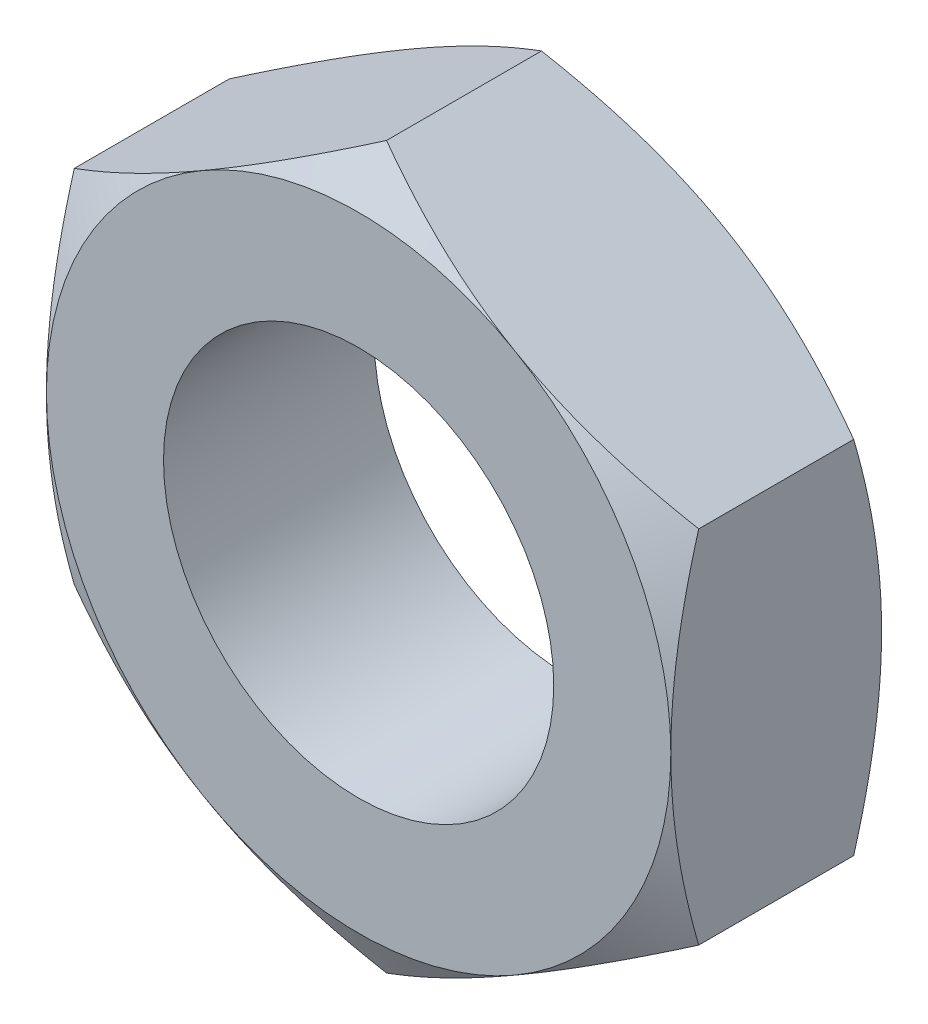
ISO-10303-21;
HEADER;
FILE_DESCRIPTION(('STEP AP214'),'2;1');
FILE_NAME('part.step','',(''),(''),'','','');
FILE_SCHEMA(('AUTOMOTIVE_DESIGN { 1 0 10303 214 1 1 1 1 }'));
ENDSEC;
DATA;
#1=APPLICATION_CONTEXT('core data for automotive mechanical design processes');
#2=APPLICATION_PROTOCOL_DEFINITION('international standard','automotive_design',2000,#1);
#3=PRODUCT_CONTEXT('',#1,'mechanical');
#4=PRODUCT('Part','Part','',(#3));
#5=PRODUCT_RELATED_PRODUCT_CATEGORY('part','',(#4));
#6=PRODUCT_DEFINITION_FORMATION('','',#4);
#7=PRODUCT_DEFINITION_CONTEXT('part definition',#1,'design');
#8=PRODUCT_DEFINITION('design','',#6,#7);
#9=PRODUCT_DEFINITION_SHAPE('','',#8);
#10=(LENGTH_UNIT() NAMED_UNIT(*) SI_UNIT(.MILLI.,.METRE.));
#11=(NAMED_UNIT(*) PLANE_ANGLE_UNIT() SI_UNIT($,.RADIAN.));
#12=(NAMED_UNIT(*) SI_UNIT($,.STERADIAN.) SOLID_ANGLE_UNIT());
#13=UNCERTAINTY_MEASURE_WITH_UNIT(LENGTH_MEASURE(1.E-05),#10,'distance_accuracy_value','');
#14=(GEOMETRIC_REPRESENTATION_CONTEXT(3) GLOBAL_UNCERTAINTY_ASSIGNED_CONTEXT((#13)) GLOBAL_UNIT_ASSIGNED_CONTEXT((#10,
#11,#12)) REPRESENTATION_CONTEXT('',''));
#15=CARTESIAN_POINT('',(0.,0.,0.));
#16=DIRECTION('',(0.,0.,1.));
#17=DIRECTION('',(1.,0.,0.));
#18=AXIS2_PLACEMENT_3D('',#15,#16,#17);
#19=CARTESIAN_POINT('',(0.,0.,2.7));
#20=DIRECTION('',(0.,0.,-1.));
#21=DIRECTION('',(-1.,0.,0.));
#22=AXIS2_PLACEMENT_3D('',#19,#20,#21);
#23=CONICAL_SURFACE('',#22,4.,1.0471975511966);
#24=CARTESIAN_POINT('',(0.000199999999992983,4.61891762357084,2.34266774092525));
#25=CARTESIAN_POINT('',(-0.175579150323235,4.5174314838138,2.40128212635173));
#26=CARTESIAN_POINT('',(-0.352875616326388,4.41506932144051,2.45458967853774));
#27=CARTESIAN_POINT('',(-0.710538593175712,4.20857250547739,2.5476383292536));
#28=CARTESIAN_POINT('',(-0.890911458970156,4.10443418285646,2.5873465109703));
#29=CARTESIAN_POINT('',(-1.24942181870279,3.89744813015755,2.64915778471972));
#30=CARTESIAN_POINT('',(-1.42750415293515,3.79463224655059,2.67167226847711));
#31=CARTESIAN_POINT('',(-1.78450671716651,3.58851671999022,2.69854937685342));
#32=CARTESIAN_POINT('',(-1.9634256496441,3.48521782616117,2.70293425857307));
#33=CARTESIAN_POINT('',(-2.29774284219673,3.29219970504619,2.69380992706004));
#34=CARTESIAN_POINT('',(-2.45319115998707,3.20245157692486,2.68254104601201));
#35=CARTESIAN_POINT('',(-2.76307505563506,3.02354002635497,2.64682600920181));
#36=CARTESIAN_POINT('',(-2.91750956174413,2.93437722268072,2.62236765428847));
#37=CARTESIAN_POINT('',(-3.22803232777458,2.75509682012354,2.56122393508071));
#38=CARTESIAN_POINT('',(-3.3840812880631,2.6650019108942,2.52427939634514));
#39=CARTESIAN_POINT('',(-3.69385183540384,2.486155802,2.44042992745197));
#40=CARTESIAN_POINT('',(-3.84757739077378,2.39740231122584,2.39354469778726));
#41=CARTESIAN_POINT('',(-4.0002,2.30928560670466,2.34266774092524));
#42=B_SPLINE_CURVE_WITH_KNOTS('',3,(#24,#25,#26,#27,#28,#29,#30,#31,#32,#33,#34,#35,#36,#37,#38,
#39,#40,#41),.UNSPECIFIED.,.F.,.F.,(4,2,2,2,2,2,2,2,4),(0.,0.634047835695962,1.26961969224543,
1.88946157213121,2.50854226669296,3.04757825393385,3.58711366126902,4.13861653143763,
4.68903648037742),.UNSPECIFIED.);
#43=CARTESIAN_POINT('',(-2.,3.46410161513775,2.7));
#44=VERTEX_POINT('',#43);
#45=CARTESIAN_POINT('',(-4.,2.3094010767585,2.34273441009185));
#46=VERTEX_POINT('',#45);
#47=EDGE_CURVE('E186',#44,#46,#42,.T.);
#48=ORIENTED_EDGE('',*,*,#47,.T.);
#49=CARTESIAN_POINT('',(-4.,-6.26364060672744,0.718589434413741));
#50=CARTESIAN_POINT('',(-4.,-6.08842377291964,0.803826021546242));
#51=CARTESIAN_POINT('',(-4.,-5.91281114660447,0.888262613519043));
#52=CARTESIAN_POINT('',(-4.,-5.5605840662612,1.055087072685));
#53=CARTESIAN_POINT('',(-4.,-5.38396946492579,1.13747462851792));
#54=CARTESIAN_POINT('',(-4.,-5.02864676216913,1.30015398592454));
#55=CARTESIAN_POINT('',(-4.,-4.84993253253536,1.38043244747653));
#56=CARTESIAN_POINT('',(-4.,-4.49110364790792,1.53778388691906));
#57=CARTESIAN_POINT('',(-4.,-4.31098905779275,1.61485701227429));
#58=CARTESIAN_POINT('',(-4.,-3.94302250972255,1.76746292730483));
#59=CARTESIAN_POINT('',(-4.,-3.75511317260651,1.84285810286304));
#60=CARTESIAN_POINT('',(-4.,-3.37711839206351,1.9880869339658));
#61=CARTESIAN_POINT('',(-4.,-3.18703271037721,2.05791997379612));
#62=CARTESIAN_POINT('',(-4.,-2.80471962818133,2.19023530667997));
#63=CARTESIAN_POINT('',(-4.,-2.61249725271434,2.25273197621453));
#64=CARTESIAN_POINT('',(-4.,-2.22529544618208,2.36840901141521));
#65=CARTESIAN_POINT('',(-4.,-2.03031688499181,2.42159224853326));
#66=CARTESIAN_POINT('',(-4.,-1.63859185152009,2.51584231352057));
#67=CARTESIAN_POINT('',(-4.,-1.44186209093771,2.55697733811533));
#68=CARTESIAN_POINT('',(-4.,-1.04589364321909,2.62485163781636));
#69=CARTESIAN_POINT('',(-4.,-0.846655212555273,2.65159237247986));
#70=CARTESIAN_POINT('',(-4.,-0.449291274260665,2.68819745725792));
#71=CARTESIAN_POINT('',(-4.,-0.251186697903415,2.69828341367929));
#72=CARTESIAN_POINT('',(-4.,0.14517164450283,2.70131104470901));
#73=CARTESIAN_POINT('',(-4.,0.34342541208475,2.69425254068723));
#74=CARTESIAN_POINT('',(-4.,0.678239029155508,2.66836003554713));
#75=CARTESIAN_POINT('',(-4.,0.815149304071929,2.65378059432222));
#76=CARTESIAN_POINT('',(-4.,1.08800080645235,2.61732105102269));
#77=CARTESIAN_POINT('',(-4.,1.2239419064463,2.59544000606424));
#78=CARTESIAN_POINT('',(-4.,1.63011244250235,2.51999097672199));
#79=CARTESIAN_POINT('',(-4.,1.89854481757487,2.45662977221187));
#80=CARTESIAN_POINT('',(-4.,2.2999975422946,2.34633889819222));
#81=CARTESIAN_POINT('',(-4.,2.4350877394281,2.30651044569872));
#82=CARTESIAN_POINT('',(-4.,2.7039569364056,2.22261108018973));
#83=CARTESIAN_POINT('',(-4.,2.83773592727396,2.17854013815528));
#84=CARTESIAN_POINT('',(-4.,3.10402296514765,2.08687174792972));
#85=CARTESIAN_POINT('',(-4.,3.2365313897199,2.03927538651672));
#86=CARTESIAN_POINT('',(-4.,3.50044341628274,1.94112660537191));
#87=CARTESIAN_POINT('',(-4.,3.63184703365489,1.89057422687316));
#88=CARTESIAN_POINT('',(-4.,3.95099591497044,1.76432597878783));
#89=CARTESIAN_POINT('',(-4.,4.13821908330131,1.68731241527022));
#90=CARTESIAN_POINT('',(-4.,4.51098760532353,1.52931419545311));
#91=CARTESIAN_POINT('',(-4.,4.69653283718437,1.44832925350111));
#92=CARTESIAN_POINT('',(-4.,5.06626865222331,1.28321706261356));
#93=CARTESIAN_POINT('',(-4.,5.25045890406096,1.19908907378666));
#94=CARTESIAN_POINT('',(-4.,5.61768203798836,1.02833991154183));
#95=CARTESIAN_POINT('',(-4.,5.8007148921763,0.941718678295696));
#96=CARTESIAN_POINT('',(-4.,6.34881556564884,0.678661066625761));
#97=CARTESIAN_POINT('',(-3.99999999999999,6.71244516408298,0.499230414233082));
#98=CARTESIAN_POINT('',(-3.99999999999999,7.43696538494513,0.13508420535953));
#99=CARTESIAN_POINT('',(-3.99999999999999,7.79785638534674,-0.0496306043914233));
#100=CARTESIAN_POINT('',(-3.99999999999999,8.4857534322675,-0.406230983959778));
#101=CARTESIAN_POINT('',(-3.99999999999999,8.81292387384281,-0.577800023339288));
#102=CARTESIAN_POINT('',(-3.99999999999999,9.46605617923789,-0.92325186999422));
#103=CARTESIAN_POINT('',(-3.99999999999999,9.79201799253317,-1.09713477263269));
#104=CARTESIAN_POINT('',(-3.99999999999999,10.4421073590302,-1.44617315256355));
#105=CARTESIAN_POINT('',(-3.99999999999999,10.7662374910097,-1.62132383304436));
#106=CARTESIAN_POINT('',(-3.99999999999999,11.4137299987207,-1.97299216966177));
#107=CARTESIAN_POINT('',(-3.99999999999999,11.7370924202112,-2.14950974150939));
#108=CARTESIAN_POINT('',(-4.,12.0601752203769,-2.32653390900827));
#109=B_SPLINE_CURVE_WITH_KNOTS('',3,(#49,#50,#51,#52,#53,#54,#55,#56,#57,#58,#59,#60,#61,#62,
#63,#64,#65,#66,#67,#68,#69,#70,#71,#72,#73,#74,#75,#76,#77,#78,#79,#80,#81,#82,#83,#84,#85,#86,
#87,#88,#89,#90,#91,#92,#93,#94,#95,#96,#97,#98,#99,#100,#101,#102,#103,#104,#105,#106,#107,
#108),.UNSPECIFIED.,.F.,.F.,(4,2,2,2,2,2,2,2,2,2,2,2,2,2,2,2,2,2,2,2,2,2,2,2,2,2,2,2,2,4),(0.,
0.584554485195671,1.16919725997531,1.75692253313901,2.344620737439,2.95196450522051,
3.5593754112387,4.16557541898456,4.77158819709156,5.37410134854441,5.97655339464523,
6.57092272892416,7.16529825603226,7.57815214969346,7.99105937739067,8.81730640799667,
9.23978652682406,9.66226953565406,10.0846228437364,10.5069702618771,11.1142392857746,
11.7215520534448,12.3290086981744,12.936479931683,14.1528724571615,15.3690939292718,
16.477363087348,17.5856780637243,18.6909540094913,19.7961623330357),.UNSPECIFIED.);
#110=CARTESIAN_POINT('',(-4.,0.,2.7));
#111=VERTEX_POINT('',#110);
#112=EDGE_CURVE('E210',#46,#111,#109,.F.);
#113=ORIENTED_EDGE('',*,*,#112,.T.);
#114=CARTESIAN_POINT('',(0.,0.,2.7));
#115=DIRECTION('',(0.,0.,-1.));
#116=DIRECTION('',(-1.,0.,0.));
#117=AXIS2_PLACEMENT_3D('',#114,#115,#116);
#118=CIRCLE('',#117,4.);
#119=EDGE_CURVE('E281',#111,#44,#118,.T.);
#120=ORIENTED_EDGE('',*,*,#119,.T.);
#121=EDGE_LOOP('',(#48,#113,#120));
#122=FACE_BOUND('',#121,.T.);
#123=ADVANCED_FACE('F14',(#122),#23,.T.);
#124=CARTESIAN_POINT('',(-2.,-3.46410161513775,2.7));
#125=VERTEX_POINT('',#124);
#126=EDGE_CURVE('E280',#125,#111,#118,.T.);
#127=ORIENTED_EDGE('',*,*,#126,.T.);
#128=CARTESIAN_POINT('',(-4.,-2.3094010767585,2.34273441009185));
#129=VERTEX_POINT('',#128);
#130=EDGE_CURVE('E203',#111,#129,#109,.F.);
#131=ORIENTED_EDGE('',*,*,#130,.T.);
#132=CARTESIAN_POINT('',(-4.0002,-2.30928560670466,2.34266774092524));
#133=CARTESIAN_POINT('',(-3.82442084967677,-2.4107717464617,2.40128212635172));
#134=CARTESIAN_POINT('',(-3.64712438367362,-2.51313390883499,2.45458967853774));
#135=CARTESIAN_POINT('',(-3.28946140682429,-2.71963072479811,2.5476383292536));
#136=CARTESIAN_POINT('',(-3.10908854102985,-2.82376904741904,2.5873465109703));
#137=CARTESIAN_POINT('',(-2.75057818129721,-3.03075510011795,2.64915778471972));
#138=CARTESIAN_POINT('',(-2.57249584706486,-3.13357098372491,2.67167226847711));
#139=CARTESIAN_POINT('',(-2.21549328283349,-3.33968651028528,2.69854937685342));
#140=CARTESIAN_POINT('',(-2.0365743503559,-3.44298540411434,2.70293425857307));
#141=CARTESIAN_POINT('',(-1.70225715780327,-3.63600352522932,2.69380992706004));
#142=CARTESIAN_POINT('',(-1.54680884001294,-3.72575165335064,2.68254104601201));
#143=CARTESIAN_POINT('',(-1.23692494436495,-3.90466320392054,2.64682600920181));
#144=CARTESIAN_POINT('',(-1.08249043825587,-3.99382600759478,2.62236765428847));
#145=CARTESIAN_POINT('',(-0.771967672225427,-4.17310641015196,2.56122393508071));
#146=CARTESIAN_POINT('',(-0.615918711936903,-4.2632013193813,2.52427939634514));
#147=CARTESIAN_POINT('',(-0.306148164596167,-4.4420474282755,2.44042992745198));
#148=CARTESIAN_POINT('',(-0.152422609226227,-4.53080091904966,2.39354469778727));
#149=CARTESIAN_POINT('',(0.000199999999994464,-4.61891762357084,2.34266774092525));
#150=B_SPLINE_CURVE_WITH_KNOTS('',3,(#132,#133,#134,#135,#136,#137,#138,#139,#140,#141,#142,
#143,#144,#145,#146,#147,#148,#149),.UNSPECIFIED.,.F.,.F.,(4,2,2,2,2,2,2,2,4),(0.,
0.634047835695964,1.26961969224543,1.88946157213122,2.50854226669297,3.04757825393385,
3.58711366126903,4.13861653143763,4.68903648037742),.UNSPECIFIED.);
#151=EDGE_CURVE('E332',#129,#125,#150,.T.);
#152=ORIENTED_EDGE('',*,*,#151,.T.);
#153=EDGE_LOOP('',(#127,#131,#152));
#154=FACE_BOUND('',#153,.T.);
#155=ADVANCED_FACE('F243',(#154),#23,.T.);
#156=CARTESIAN_POINT('',(2.,-3.46410161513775,2.7));
#157=VERTEX_POINT('',#156);
#158=EDGE_CURVE('E277',#157,#125,#118,.T.);
#159=ORIENTED_EDGE('',*,*,#158,.T.);
#160=CARTESIAN_POINT('',(0.,-4.618802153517,2.34273441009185));
#161=VERTEX_POINT('',#160);
#162=EDGE_CURVE('E219',#125,#161,#150,.T.);
#163=ORIENTED_EDGE('',*,*,#162,.T.);
#164=CARTESIAN_POINT('',(-0.000200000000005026,-4.61891762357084,2.34266774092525));
#165=CARTESIAN_POINT('',(0.175579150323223,-4.5174314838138,2.40128212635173));
#166=CARTESIAN_POINT('',(0.352875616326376,-4.41506932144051,2.45458967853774));
#167=CARTESIAN_POINT('',(0.7105385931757,-4.20857250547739,2.5476383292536));
#168=CARTESIAN_POINT('',(0.890911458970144,-4.10443418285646,2.5873465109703));
#169=CARTESIAN_POINT('',(1.24942181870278,-3.89744813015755,2.64915778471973));
#170=CARTESIAN_POINT('',(1.42750415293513,-3.79463224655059,2.67167226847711));
#171=CARTESIAN_POINT('',(1.7845067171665,-3.58851671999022,2.69854937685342));
#172=CARTESIAN_POINT('',(1.96342564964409,-3.48521782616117,2.70293425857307));
#173=CARTESIAN_POINT('',(2.29774284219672,-3.29219970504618,2.69380992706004));
#174=CARTESIAN_POINT('',(2.45319115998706,-3.20245157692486,2.68254104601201));
#175=CARTESIAN_POINT('',(2.76307505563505,-3.02354002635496,2.64682600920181));
#176=CARTESIAN_POINT('',(2.91750956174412,-2.93437722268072,2.62236765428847));
#177=CARTESIAN_POINT('',(3.22803232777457,-2.75509682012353,2.56122393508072));
#178=CARTESIAN_POINT('',(3.38408128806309,-2.66500191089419,2.52427939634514));
#179=CARTESIAN_POINT('',(3.69385183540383,-2.486155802,2.44042992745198));
#180=CARTESIAN_POINT('',(3.84757739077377,-2.39740231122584,2.39354469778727));
#181=CARTESIAN_POINT('',(4.0002,-2.30928560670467,2.34266774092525));
#182=B_SPLINE_CURVE_WITH_KNOTS('',3,(#164,#165,#166,#167,#168,#169,#170,#171,#172,#173,#174,
#175,#176,#177,#178,#179,#180,#181),.UNSPECIFIED.,.F.,.F.,(4,2,2,2,2,2,2,2,4),(0.,
0.634047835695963,1.26961969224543,1.88946157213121,2.50854226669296,3.04757825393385,
3.58711366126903,4.13861653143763,4.68903648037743),.UNSPECIFIED.);
#183=EDGE_CURVE('E288',#161,#157,#182,.T.);
#184=ORIENTED_EDGE('',*,*,#183,.T.);
#185=EDGE_LOOP('',(#159,#163,#184));
#186=FACE_BOUND('',#185,.T.);
#187=ADVANCED_FACE('F248',(#186),#23,.T.);
#188=CARTESIAN_POINT('',(4.0002,2.30928560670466,2.34266774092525));
#189=CARTESIAN_POINT('',(3.82442084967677,2.4107717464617,2.40128212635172));
#190=CARTESIAN_POINT('',(3.64712438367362,2.51313390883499,2.45458967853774));
#191=CARTESIAN_POINT('',(3.28946140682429,2.71963072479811,2.5476383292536));
#192=CARTESIAN_POINT('',(3.10908854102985,2.82376904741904,2.5873465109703));
#193=CARTESIAN_POINT('',(2.75057818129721,3.03075510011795,2.64915778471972));
#194=CARTESIAN_POINT('',(2.57249584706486,3.13357098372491,2.67167226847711));
#195=CARTESIAN_POINT('',(2.21549328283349,3.33968651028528,2.69854937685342));
#196=CARTESIAN_POINT('',(2.0365743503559,3.44298540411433,2.70293425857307));
#197=CARTESIAN_POINT('',(1.70225715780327,3.63600352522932,2.69380992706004));
#198=CARTESIAN_POINT('',(1.54680884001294,3.72575165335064,2.68254104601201));
#199=CARTESIAN_POINT('',(1.23692494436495,3.90466320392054,2.64682600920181));
#200=CARTESIAN_POINT('',(1.08249043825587,3.99382600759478,2.62236765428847));
#201=CARTESIAN_POINT('',(0.771967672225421,4.17310641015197,2.56122393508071));
#202=CARTESIAN_POINT('',(0.615918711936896,4.26320131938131,2.52427939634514));
#203=CARTESIAN_POINT('',(0.306148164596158,4.4420474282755,2.44042992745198));
#204=CARTESIAN_POINT('',(0.152422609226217,4.53080091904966,2.39354469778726));
#205=CARTESIAN_POINT('',(-0.000200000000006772,4.61891762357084,2.34266774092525));
#206=B_SPLINE_CURVE_WITH_KNOTS('',3,(#188,#189,#190,#191,#192,#193,#194,#195,#196,#197,#198,
#199,#200,#201,#202,#203,#204,#205),.UNSPECIFIED.,.F.,.F.,(4,2,2,2,2,2,2,2,4),(0.,
0.634047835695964,1.26961969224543,1.88946157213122,2.50854226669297,3.04757825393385,
3.58711366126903,4.13861653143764,4.68903648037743),.UNSPECIFIED.);
#207=CARTESIAN_POINT('',(2.,3.46410161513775,2.7));
#208=VERTEX_POINT('',#207);
#209=CARTESIAN_POINT('',(0.,4.618802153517,2.34273441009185));
#210=VERTEX_POINT('',#209);
#211=EDGE_CURVE('E141',#208,#210,#206,.T.);
#212=ORIENTED_EDGE('',*,*,#211,.T.);
#213=EDGE_CURVE('E193',#210,#44,#42,.T.);
#214=ORIENTED_EDGE('',*,*,#213,.T.);
#215=EDGE_CURVE('E278',#44,#208,#118,.T.);
#216=ORIENTED_EDGE('',*,*,#215,.T.);
#217=EDGE_LOOP('',(#212,#214,#216));
#218=FACE_BOUND('',#217,.T.);
#219=ADVANCED_FACE('F259',(#218),#23,.T.);
#220=CARTESIAN_POINT('',(4.,0.,2.7));
#221=VERTEX_POINT('',#220);
#222=EDGE_CURVE('E271',#221,#157,#118,.T.);
#223=ORIENTED_EDGE('',*,*,#222,.T.);
#224=CARTESIAN_POINT('',(4.,-2.3094010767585,2.34273441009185));
#225=VERTEX_POINT('',#224);
#226=EDGE_CURVE('E272',#157,#225,#182,.T.);
#227=ORIENTED_EDGE('',*,*,#226,.T.);
#228=CARTESIAN_POINT('',(4.,-6.26364060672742,0.718589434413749));
#229=CARTESIAN_POINT('',(4.,-6.08842377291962,0.803826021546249));
#230=CARTESIAN_POINT('',(4.,-5.91281114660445,0.888262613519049));
#231=CARTESIAN_POINT('',(4.,-5.56058406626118,1.05508707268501));
#232=CARTESIAN_POINT('',(4.,-5.38396946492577,1.13747462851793));
#233=CARTESIAN_POINT('',(4.,-5.02864676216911,1.30015398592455));
#234=CARTESIAN_POINT('',(4.,-4.84993253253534,1.38043244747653));
#235=CARTESIAN_POINT('',(4.,-4.4911036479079,1.53778388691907));
#236=CARTESIAN_POINT('',(4.,-4.31098905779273,1.61485701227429));
#237=CARTESIAN_POINT('',(4.,-3.94302250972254,1.76746292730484));
#238=CARTESIAN_POINT('',(4.,-3.75511317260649,1.84285810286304));
#239=CARTESIAN_POINT('',(4.,-3.37711839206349,1.98808693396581));
#240=CARTESIAN_POINT('',(4.,-3.1870327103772,2.05791997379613));
#241=CARTESIAN_POINT('',(4.,-2.80471962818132,2.19023530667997));
#242=CARTESIAN_POINT('',(4.,-2.61249725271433,2.25273197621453));
#243=CARTESIAN_POINT('',(4.,-2.22529544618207,2.36840901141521));
#244=CARTESIAN_POINT('',(4.,-2.0303168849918,2.42159224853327));
#245=CARTESIAN_POINT('',(4.,-1.63859185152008,2.51584231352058));
#246=CARTESIAN_POINT('',(4.,-1.4418620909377,2.55697733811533));
#247=CARTESIAN_POINT('',(4.,-1.04589364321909,2.62485163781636));
#248=CARTESIAN_POINT('',(4.,-0.846655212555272,2.65159237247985));
#249=CARTESIAN_POINT('',(4.,-0.449291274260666,2.68819745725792));
#250=CARTESIAN_POINT('',(4.,-0.251186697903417,2.69828341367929));
#251=CARTESIAN_POINT('',(4.,0.145171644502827,2.70131104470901));
#252=CARTESIAN_POINT('',(4.,0.343425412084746,2.69425254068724));
#253=CARTESIAN_POINT('',(4.,0.678239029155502,2.66836003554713));
#254=CARTESIAN_POINT('',(4.,0.815149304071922,2.65378059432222));
#255=CARTESIAN_POINT('',(4.,1.08800080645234,2.61732105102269));
#256=CARTESIAN_POINT('',(4.,1.22394190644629,2.59544000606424));
#257=CARTESIAN_POINT('',(4.,1.63011244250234,2.51999097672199));
#258=CARTESIAN_POINT('',(4.,1.89854481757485,2.45662977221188));
#259=CARTESIAN_POINT('',(4.,2.29999754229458,2.34633889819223));
#260=CARTESIAN_POINT('',(4.,2.43508773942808,2.30651044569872));
#261=CARTESIAN_POINT('',(4.,2.70395693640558,2.22261108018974));
#262=CARTESIAN_POINT('',(4.,2.83773592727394,2.17854013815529));
#263=CARTESIAN_POINT('',(4.,3.10402296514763,2.08687174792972));
#264=CARTESIAN_POINT('',(4.,3.23653138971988,2.03927538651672));
#265=CARTESIAN_POINT('',(4.,3.50044341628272,1.94112660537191));
#266=CARTESIAN_POINT('',(4.,3.63184703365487,1.89057422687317));
#267=CARTESIAN_POINT('',(4.,3.95099591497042,1.76432597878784));
#268=CARTESIAN_POINT('',(4.,4.13821908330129,1.68731241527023));
#269=CARTESIAN_POINT('',(4.,4.5109876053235,1.52931419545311));
#270=CARTESIAN_POINT('',(4.,4.69653283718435,1.44832925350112));
#271=CARTESIAN_POINT('',(4.,5.06626865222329,1.28321706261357));
#272=CARTESIAN_POINT('',(4.,5.25045890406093,1.19908907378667));
#273=CARTESIAN_POINT('',(4.,5.61768203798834,1.02833991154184));
#274=CARTESIAN_POINT('',(4.,5.80071489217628,0.941718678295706));
#275=CARTESIAN_POINT('',(4.,6.34881556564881,0.678661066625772));
#276=CARTESIAN_POINT('',(4.00000000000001,6.71244516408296,0.499230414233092));
#277=CARTESIAN_POINT('',(4.00000000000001,7.4369653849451,0.13508420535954));
#278=CARTESIAN_POINT('',(4.00000000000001,7.79785638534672,-0.0496306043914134));
#279=CARTESIAN_POINT('',(4.00000000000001,8.48575343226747,-0.406230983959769));
#280=CARTESIAN_POINT('',(4.00000000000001,8.81292387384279,-0.577800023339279));
#281=CARTESIAN_POINT('',(4.00000000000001,9.46605617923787,-0.923251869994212));
#282=CARTESIAN_POINT('',(4.00000000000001,9.79201799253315,-1.09713477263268));
#283=CARTESIAN_POINT('',(4.00000000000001,10.4421073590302,-1.44617315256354));
#284=CARTESIAN_POINT('',(4.00000000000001,10.7662374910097,-1.62132383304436));
#285=CARTESIAN_POINT('',(4.00000000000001,11.4137299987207,-1.97299216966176));
#286=CARTESIAN_POINT('',(4.00000000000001,11.7370924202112,-2.14950974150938));
#287=CARTESIAN_POINT('',(4.,12.0601752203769,-2.32653390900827));
#288=B_SPLINE_CURVE_WITH_KNOTS('',3,(#228,#229,#230,#231,#232,#233,#234,#235,#236,#237,#238,
#239,#240,#241,#242,#243,#244,#245,#246,#247,#248,#249,#250,#251,#252,#253,#254,#255,#256,#257,
#258,#259,#260,#261,#262,#263,#264,#265,#266,#267,#268,#269,#270,#271,#272,#273,#274,#275,#276,
#277,#278,#279,#280,#281,#282,#283,#284,#285,#286,#287),.UNSPECIFIED.,.F.,.F.,(4,2,2,2,2,2,2,2,
2,2,2,2,2,2,2,2,2,2,2,2,2,2,2,2,2,2,2,2,2,4),(0.,0.584554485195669,1.1691972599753,
1.75692253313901,2.344620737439,2.95196450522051,3.55937541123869,4.16557541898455,
4.77158819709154,5.37410134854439,5.9765533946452,6.57092272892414,7.16529825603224,
7.57815214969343,7.99105937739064,8.81730640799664,9.23978652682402,9.66226953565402,
10.0846228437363,10.506970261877,11.1142392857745,11.7215520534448,12.3290086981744,
12.936479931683,14.1528724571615,15.3690939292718,16.4773630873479,17.5856780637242,
18.6909540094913,19.7961623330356),.UNSPECIFIED.);
#289=EDGE_CURVE('E146',#225,#221,#288,.T.);
#290=ORIENTED_EDGE('',*,*,#289,.T.);
#291=EDGE_LOOP('',(#223,#227,#290));
#292=FACE_BOUND('',#291,.T.);
#293=ADVANCED_FACE('F252',(#292),#23,.T.);
#294=CARTESIAN_POINT('',(0.,0.,1.35000000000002));
#295=DIRECTION('',(0.,0.,1.));
#296=DIRECTION('',(1.,0.,0.));
#297=AXIS2_PLACEMENT_3D('',#294,#295,#296);
#298=CONICAL_SURFACE('',#297,6.338268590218,1.0471975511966);
#299=CARTESIAN_POINT('',(4.,-6.26364060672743,1.9814105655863));
#300=CARTESIAN_POINT('',(4.,-6.08842377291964,1.89617397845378));
#301=CARTESIAN_POINT('',(4.,-5.91281114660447,1.81173738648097));
#302=CARTESIAN_POINT('',(4.,-5.5605840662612,1.64491292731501));
#303=CARTESIAN_POINT('',(4.,-5.38396946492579,1.56252537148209));
#304=CARTESIAN_POINT('',(4.,-5.02864676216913,1.39984601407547));
#305=CARTESIAN_POINT('',(4.,-4.84993253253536,1.31956755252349));
#306=CARTESIAN_POINT('',(4.,-4.49110364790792,1.16221611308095));
#307=CARTESIAN_POINT('',(4.,-4.31098905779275,1.08514298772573));
#308=CARTESIAN_POINT('',(4.,-3.94302250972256,0.932537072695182));
#309=CARTESIAN_POINT('',(4.00000000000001,-3.75511317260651,0.857141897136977));
#310=CARTESIAN_POINT('',(4.00000000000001,-3.37711839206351,0.711913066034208));
#311=CARTESIAN_POINT('',(4.,-3.18703271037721,0.642080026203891));
#312=CARTESIAN_POINT('',(4.00000000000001,-2.80471962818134,0.509764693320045));
#313=CARTESIAN_POINT('',(4.00000000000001,-2.61249725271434,0.447268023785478));
#314=CARTESIAN_POINT('',(4.,-2.22529544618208,0.331590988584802));
#315=CARTESIAN_POINT('',(4.,-2.03031688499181,0.278407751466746));
#316=CARTESIAN_POINT('',(4.,-1.63859185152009,0.184157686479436));
#317=CARTESIAN_POINT('',(4.00000000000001,-1.44186209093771,0.143022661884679));
#318=CARTESIAN_POINT('',(4.00000000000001,-1.04589364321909,0.0751483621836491));
#319=CARTESIAN_POINT('',(4.00000000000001,-0.846655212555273,0.0484076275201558));
#320=CARTESIAN_POINT('',(4.00000000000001,-0.449291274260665,0.0118025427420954));
#321=CARTESIAN_POINT('',(4.00000000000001,-0.251186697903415,0.00171658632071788));
#322=CARTESIAN_POINT('',(4.00000000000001,0.14517164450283,-0.0013110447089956));
#323=CARTESIAN_POINT('',(4.,0.343425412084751,0.00574745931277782));
#324=CARTESIAN_POINT('',(4.,0.678239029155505,0.031639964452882));
#325=CARTESIAN_POINT('',(4.00000000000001,0.815149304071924,0.0462194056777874));
#326=CARTESIAN_POINT('',(4.00000000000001,1.08800080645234,0.0826789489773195));
#327=CARTESIAN_POINT('',(4.00000000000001,1.22394190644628,0.10455999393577));
#328=CARTESIAN_POINT('',(4.00000000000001,1.63011244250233,0.180009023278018));
#329=CARTESIAN_POINT('',(4.00000000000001,1.89854481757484,0.243370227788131));
#330=CARTESIAN_POINT('',(4.00000000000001,2.29999754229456,0.353661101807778));
#331=CARTESIAN_POINT('',(4.00000000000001,2.43508773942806,0.393489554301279));
#332=CARTESIAN_POINT('',(4.00000000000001,2.70395693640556,0.477388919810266));
#333=CARTESIAN_POINT('',(4.00000000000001,2.83773592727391,0.521459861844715));
#334=CARTESIAN_POINT('',(4.00000000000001,3.1040229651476,0.613128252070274));
#335=CARTESIAN_POINT('',(4.00000000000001,3.23653138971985,0.660724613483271));
#336=CARTESIAN_POINT('',(4.,3.50044341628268,0.758873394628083));
#337=CARTESIAN_POINT('',(4.,3.63184703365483,0.809425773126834));
#338=CARTESIAN_POINT('',(4.,3.95099591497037,0.93567402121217));
#339=CARTESIAN_POINT('',(4.,4.13821908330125,1.01268758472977));
#340=CARTESIAN_POINT('',(4.00000000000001,4.51098760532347,1.17068580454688));
#341=CARTESIAN_POINT('',(4.,4.69653283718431,1.25167074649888));
#342=CARTESIAN_POINT('',(4.,5.06626865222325,1.41678293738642));
#343=CARTESIAN_POINT('',(4.,5.2504589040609,1.50091092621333));
#344=CARTESIAN_POINT('',(4.,5.6176820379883,1.67166008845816));
#345=CARTESIAN_POINT('',(4.,5.80071489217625,1.75828132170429));
#346=CARTESIAN_POINT('',(4.,6.34881556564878,2.02133893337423));
#347=CARTESIAN_POINT('',(4.,6.71244516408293,2.20076958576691));
#348=CARTESIAN_POINT('',(4.,7.43696538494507,2.56491579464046));
#349=CARTESIAN_POINT('',(4.,7.79785638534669,2.74963060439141));
#350=CARTESIAN_POINT('',(4.,8.48575343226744,3.10623098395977));
#351=CARTESIAN_POINT('',(4.,8.81292387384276,3.27780002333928));
#352=CARTESIAN_POINT('',(4.,9.46605617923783,3.62325186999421));
#353=CARTESIAN_POINT('',(4.,9.79201799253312,3.79713477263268));
#354=CARTESIAN_POINT('',(4.,10.4421073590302,4.14617315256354));
#355=CARTESIAN_POINT('',(4.,10.7662374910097,4.32132383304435));
#356=CARTESIAN_POINT('',(4.,11.4137299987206,4.67299216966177));
#357=CARTESIAN_POINT('',(4.,11.7370924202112,4.8495097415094));
#358=CARTESIAN_POINT('',(4.,12.0601752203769,5.02653390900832));
#359=B_SPLINE_CURVE_WITH_KNOTS('',3,(#299,#300,#301,#302,#303,#304,#305,#306,#307,#308,#309,
#310,#311,#312,#313,#314,#315,#316,#317,#318,#319,#320,#321,#322,#323,#324,#325,#326,#327,#328,
#329,#330,#331,#332,#333,#334,#335,#336,#337,#338,#339,#340,#341,#342,#343,#344,#345,#346,#347,
#348,#349,#350,#351,#352,#353,#354,#355,#356,#357,#358),.UNSPECIFIED.,.F.,.F.,(4,2,2,2,2,2,2,2,
2,2,2,2,2,2,2,2,2,2,2,2,2,2,2,2,2,2,2,2,2,4),(0.,0.584554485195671,1.16919725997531,
1.75692253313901,2.344620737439,2.95196450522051,3.5593754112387,4.16557541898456,
4.77158819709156,5.37410134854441,5.97655339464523,6.57092272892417,7.16529825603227,
7.57815214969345,7.99105937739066,8.81730640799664,9.23978652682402,9.66226953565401,
10.0846228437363,10.506970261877,11.1142392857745,11.7215520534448,12.3290086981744,
12.936479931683,14.1528724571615,15.3690939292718,16.4773630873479,17.5856780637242,
18.6909540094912,19.7961623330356),.UNSPECIFIED.);
#360=CARTESIAN_POINT('',(4.,0.,0.));
#361=VERTEX_POINT('',#360);
#362=CARTESIAN_POINT('',(4.,-2.3094010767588,0.357265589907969));
#363=VERTEX_POINT('',#362);
#364=EDGE_CURVE('E102',#361,#363,#359,.F.);
#365=ORIENTED_EDGE('',*,*,#364,.T.);
#366=CARTESIAN_POINT('',(4.0002,-2.30928560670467,0.357332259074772));
#367=CARTESIAN_POINT('',(3.82442084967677,-2.4107717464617,0.298717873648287));
#368=CARTESIAN_POINT('',(3.64712438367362,-2.51313390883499,0.245410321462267));
#369=CARTESIAN_POINT('',(3.28946140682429,-2.71963072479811,0.152361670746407));
#370=CARTESIAN_POINT('',(3.10908854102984,-2.82376904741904,0.112653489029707));
#371=CARTESIAN_POINT('',(2.75057818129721,-3.03075510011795,0.0508422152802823));
#372=CARTESIAN_POINT('',(2.57249584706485,-3.13357098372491,0.0283277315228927));
#373=CARTESIAN_POINT('',(2.21549328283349,-3.33968651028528,0.00145062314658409));
#374=CARTESIAN_POINT('',(2.03657435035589,-3.44298540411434,-0.00293425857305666));
#375=CARTESIAN_POINT('',(1.70225715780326,-3.63600352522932,0.00619007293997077));
#376=CARTESIAN_POINT('',(1.54680884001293,-3.72575165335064,0.0174589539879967));
#377=CARTESIAN_POINT('',(1.23692494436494,-3.90466320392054,0.0531739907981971));
#378=CARTESIAN_POINT('',(1.08249043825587,-3.99382600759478,0.0776323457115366));
#379=CARTESIAN_POINT('',(0.77196767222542,-4.17310641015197,0.138776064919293));
#380=CARTESIAN_POINT('',(0.615918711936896,-4.26320131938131,0.175720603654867));
#381=CARTESIAN_POINT('',(0.306148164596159,-4.4420474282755,0.25957007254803));
#382=CARTESIAN_POINT('',(0.15242260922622,-4.53080091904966,0.306455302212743));
#383=CARTESIAN_POINT('',(-0.000199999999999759,-4.61891762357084,0.357332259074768));
#384=B_SPLINE_CURVE_WITH_KNOTS('',3,(#366,#367,#368,#369,#370,#371,#372,#373,#374,#375,#376,
#377,#378,#379,#380,#381,#382,#383),.UNSPECIFIED.,.F.,.F.,(4,2,2,2,2,2,2,2,4),(0.,
0.634047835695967,1.26961969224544,1.88946157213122,2.50854226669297,3.04757825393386,
3.58711366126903,4.13861653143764,4.68903648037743),.UNSPECIFIED.);
#385=CARTESIAN_POINT('',(2.,-3.46410161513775,0.));
#386=VERTEX_POINT('',#385);
#387=EDGE_CURVE('E123',#363,#386,#384,.T.);
#388=ORIENTED_EDGE('',*,*,#387,.T.);
#389=CARTESIAN_POINT('',(0.,0.,0.));
#390=DIRECTION('',(0.,0.,-1.));
#391=DIRECTION('',(-1.,0.,0.));
#392=AXIS2_PLACEMENT_3D('',#389,#390,#391);
#393=CIRCLE('',#392,4.);
#394=EDGE_CURVE('E121',#361,#386,#393,.T.);
#395=ORIENTED_EDGE('',*,*,#394,.F.);
#396=EDGE_LOOP('',(#365,#388,#395));
#397=FACE_BOUND('',#396,.T.);
#398=ADVANCED_FACE('F122',(#397),#298,.T.);
#399=CARTESIAN_POINT('',(-2.,-3.46410161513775,0.));
#400=VERTEX_POINT('',#399);
#401=EDGE_CURVE('E127',#386,#400,#393,.T.);
#402=ORIENTED_EDGE('',*,*,#401,.F.);
#403=CARTESIAN_POINT('',(0.,-4.618802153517,0.357265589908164));
#404=VERTEX_POINT('',#403);
#405=EDGE_CURVE('E289',#386,#404,#384,.T.);
#406=ORIENTED_EDGE('',*,*,#405,.T.);
#407=CARTESIAN_POINT('',(0.000199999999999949,-4.61891762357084,0.357332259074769));
#408=CARTESIAN_POINT('',(-0.175579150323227,-4.5174314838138,0.298717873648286));
#409=CARTESIAN_POINT('',(-0.352875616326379,-4.41506932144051,0.245410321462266));
#410=CARTESIAN_POINT('',(-0.710538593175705,-4.20857250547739,0.152361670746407));
#411=CARTESIAN_POINT('',(-0.89091145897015,-4.10443418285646,0.112653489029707));
#412=CARTESIAN_POINT('',(-1.24942181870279,-3.89744813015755,0.0508422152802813));
#413=CARTESIAN_POINT('',(-1.42750415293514,-3.79463224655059,0.0283277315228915));
#414=CARTESIAN_POINT('',(-1.78450671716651,-3.58851671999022,0.00145062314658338));
#415=CARTESIAN_POINT('',(-1.9634256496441,-3.48521782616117,-0.00293425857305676));
#416=CARTESIAN_POINT('',(-2.29774284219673,-3.29219970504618,0.00619007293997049));
#417=CARTESIAN_POINT('',(-2.45319115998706,-3.20245157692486,0.0174589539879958));
#418=CARTESIAN_POINT('',(-2.76307505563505,-3.02354002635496,0.0531739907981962));
#419=CARTESIAN_POINT('',(-2.91750956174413,-2.93437722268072,0.0776323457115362));
#420=CARTESIAN_POINT('',(-3.22803232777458,-2.75509682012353,0.138776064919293));
#421=CARTESIAN_POINT('',(-3.3840812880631,-2.66500191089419,0.175720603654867));
#422=CARTESIAN_POINT('',(-3.69385183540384,-2.486155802,0.259570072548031));
#423=CARTESIAN_POINT('',(-3.84757739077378,-2.39740231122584,0.306455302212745));
#424=CARTESIAN_POINT('',(-4.0002,-2.30928560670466,0.357332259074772));
#425=B_SPLINE_CURVE_WITH_KNOTS('',3,(#407,#408,#409,#410,#411,#412,#413,#414,#415,#416,#417,
#418,#419,#420,#421,#422,#423,#424),.UNSPECIFIED.,.F.,.F.,(4,2,2,2,2,2,2,2,4),(0.,
0.634047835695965,1.26961969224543,1.88946157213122,2.50854226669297,3.04757825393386,
3.58711366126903,4.13861653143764,4.68903648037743),.UNSPECIFIED.);
#426=EDGE_CURVE('E218',#404,#400,#425,.T.);
#427=ORIENTED_EDGE('',*,*,#426,.T.);
#428=EDGE_LOOP('',(#402,#406,#427));
#429=FACE_BOUND('',#428,.T.);
#430=ADVANCED_FACE('F265',(#429),#298,.T.);
#431=CARTESIAN_POINT('',(-4.,0.,0.));
#432=VERTEX_POINT('',#431);
#433=EDGE_CURVE('E24',#400,#432,#393,.T.);
#434=ORIENTED_EDGE('',*,*,#433,.F.);
#435=CARTESIAN_POINT('',(-4.,-2.3094010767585,0.357265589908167));
#436=VERTEX_POINT('',#435);
#437=EDGE_CURVE('E211',#400,#436,#425,.T.);
#438=ORIENTED_EDGE('',*,*,#437,.T.);
#439=CARTESIAN_POINT('',(-4.,-6.26364060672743,1.9814105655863));
#440=CARTESIAN_POINT('',(-4.,-6.08842377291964,1.89617397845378));
#441=CARTESIAN_POINT('',(-4.,-5.91281114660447,1.81173738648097));
#442=CARTESIAN_POINT('',(-4.,-5.5605840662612,1.64491292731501));
#443=CARTESIAN_POINT('',(-4.,-5.38396946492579,1.56252537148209));
#444=CARTESIAN_POINT('',(-4.,-5.02864676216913,1.39984601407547));
#445=CARTESIAN_POINT('',(-4.,-4.84993253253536,1.31956755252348));
#446=CARTESIAN_POINT('',(-4.,-4.49110364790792,1.16221611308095));
#447=CARTESIAN_POINT('',(-4.,-4.31098905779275,1.08514298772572));
#448=CARTESIAN_POINT('',(-4.,-3.94302250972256,0.932537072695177));
#449=CARTESIAN_POINT('',(-3.99999999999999,-3.75511317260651,0.857141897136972));
#450=CARTESIAN_POINT('',(-3.99999999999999,-3.37711839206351,0.711913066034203));
#451=CARTESIAN_POINT('',(-4.,-3.18703271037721,0.642080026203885));
#452=CARTESIAN_POINT('',(-3.99999999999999,-2.80471962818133,0.509764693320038));
#453=CARTESIAN_POINT('',(-3.99999999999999,-2.61249725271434,0.44726802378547));
#454=CARTESIAN_POINT('',(-4.,-2.22529544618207,0.331590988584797));
#455=CARTESIAN_POINT('',(-4.,-2.0303168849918,0.278407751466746));
#456=CARTESIAN_POINT('',(-4.,-1.63859185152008,0.184157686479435));
#457=CARTESIAN_POINT('',(-3.99999999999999,-1.4418620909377,0.143022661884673));
#458=CARTESIAN_POINT('',(-3.99999999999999,-1.04589364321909,0.0751483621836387));
#459=CARTESIAN_POINT('',(-3.99999999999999,-0.846655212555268,0.0484076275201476));
#460=CARTESIAN_POINT('',(-3.99999999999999,-0.449291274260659,0.0118025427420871));
#461=CARTESIAN_POINT('',(-3.99999999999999,-0.251186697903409,0.00171658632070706));
#462=CARTESIAN_POINT('',(-3.99999999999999,0.145171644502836,-0.00131104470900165));
#463=CARTESIAN_POINT('',(-4.,0.343425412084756,0.005747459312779));
#464=CARTESIAN_POINT('',(-4.,0.678239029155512,0.0316399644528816));
#465=CARTESIAN_POINT('',(-3.99999999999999,0.815149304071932,0.0462194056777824));
#466=CARTESIAN_POINT('',(-3.99999999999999,1.08800080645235,0.0826789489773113));
#467=CARTESIAN_POINT('',(-3.99999999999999,1.22394190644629,0.104559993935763));
#468=CARTESIAN_POINT('',(-3.99999999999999,1.63011244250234,0.180009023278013));
#469=CARTESIAN_POINT('',(-3.99999999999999,1.89854481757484,0.243370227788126));
#470=CARTESIAN_POINT('',(-3.99999999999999,2.29999754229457,0.353661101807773));
#471=CARTESIAN_POINT('',(-3.99999999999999,2.43508773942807,0.393489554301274));
#472=CARTESIAN_POINT('',(-3.99999999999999,2.70395693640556,0.477388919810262));
#473=CARTESIAN_POINT('',(-3.99999999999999,2.83773592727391,0.521459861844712));
#474=CARTESIAN_POINT('',(-3.99999999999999,3.1040229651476,0.61312825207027));
#475=CARTESIAN_POINT('',(-3.99999999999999,3.23653138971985,0.660724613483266));
#476=CARTESIAN_POINT('',(-4.,3.50044341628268,0.758873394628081));
#477=CARTESIAN_POINT('',(-4.,3.63184703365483,0.809425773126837));
#478=CARTESIAN_POINT('',(-4.,3.95099591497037,0.935674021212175));
#479=CARTESIAN_POINT('',(-4.,4.13821908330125,1.01268758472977));
#480=CARTESIAN_POINT('',(-3.99999999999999,4.51098760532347,1.17068580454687));
#481=CARTESIAN_POINT('',(-4.,4.69653283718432,1.25167074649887));
#482=CARTESIAN_POINT('',(-4.,5.06626865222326,1.41678293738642));
#483=CARTESIAN_POINT('',(-4.,5.2504589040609,1.50091092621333));
#484=CARTESIAN_POINT('',(-4.,5.61768203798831,1.67166008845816));
#485=CARTESIAN_POINT('',(-4.,5.80071489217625,1.75828132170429));
#486=CARTESIAN_POINT('',(-4.,6.34881556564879,2.02133893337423));
#487=CARTESIAN_POINT('',(-4.,6.71244516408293,2.20076958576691));
#488=CARTESIAN_POINT('',(-4.,7.43696538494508,2.56491579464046));
#489=CARTESIAN_POINT('',(-4.,7.79785638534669,2.74963060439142));
#490=CARTESIAN_POINT('',(-4.,8.48575343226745,3.10623098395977));
#491=CARTESIAN_POINT('',(-4.,8.81292387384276,3.27780002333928));
#492=CARTESIAN_POINT('',(-4.,9.46605617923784,3.62325186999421));
#493=CARTESIAN_POINT('',(-4.,9.79201799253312,3.79713477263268));
#494=CARTESIAN_POINT('',(-4.,10.4421073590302,4.14617315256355));
#495=CARTESIAN_POINT('',(-4.,10.7662374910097,4.32132383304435));
#496=CARTESIAN_POINT('',(-4.,11.4137299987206,4.67299216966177));
#497=CARTESIAN_POINT('',(-4.,11.7370924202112,4.8495097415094));
#498=CARTESIAN_POINT('',(-4.,12.0601752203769,5.02653390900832));
#499=B_SPLINE_CURVE_WITH_KNOTS('',3,(#439,#440,#441,#442,#443,#444,#445,#446,#447,#448,#449,
#450,#451,#452,#453,#454,#455,#456,#457,#458,#459,#460,#461,#462,#463,#464,#465,#466,#467,#468,
#469,#470,#471,#472,#473,#474,#475,#476,#477,#478,#479,#480,#481,#482,#483,#484,#485,#486,#487,
#488,#489,#490,#491,#492,#493,#494,#495,#496,#497,#498),.UNSPECIFIED.,.F.,.F.,(4,2,2,2,2,2,2,2,
2,2,2,2,2,2,2,2,2,2,2,2,2,2,2,2,2,2,2,2,2,4),(0.,0.584554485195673,1.16919725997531,
1.75692253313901,2.34462073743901,2.95196450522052,3.5593754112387,4.16557541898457,
4.77158819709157,5.37410134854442,5.97655339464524,6.57092272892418,7.16529825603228,
7.57815214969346,7.99105937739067,8.81730640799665,9.23978652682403,9.66226953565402,
10.0846228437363,10.506970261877,11.1142392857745,11.7215520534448,12.3290086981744,
12.936479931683,14.1528724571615,15.3690939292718,16.4773630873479,17.5856780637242,
18.6909540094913,19.7961623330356),.UNSPECIFIED.);
#500=EDGE_CURVE('E202',#436,#432,#499,.T.);
#501=ORIENTED_EDGE('',*,*,#500,.T.);
#502=EDGE_LOOP('',(#434,#438,#501));
#503=FACE_BOUND('',#502,.T.);
#504=ADVANCED_FACE('F337',(#503),#298,.T.);
#505=CARTESIAN_POINT('',(-2.,3.46410161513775,0.));
#506=VERTEX_POINT('',#505);
#507=EDGE_CURVE('E9',#432,#506,#393,.T.);
#508=ORIENTED_EDGE('',*,*,#507,.F.);
#509=CARTESIAN_POINT('',(-4.,2.3094010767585,0.357265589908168));
#510=VERTEX_POINT('',#509);
#511=EDGE_CURVE('E195',#432,#510,#499,.T.);
#512=ORIENTED_EDGE('',*,*,#511,.T.);
#513=CARTESIAN_POINT('',(-4.0002,2.30928560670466,0.357332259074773));
#514=CARTESIAN_POINT('',(-3.82442084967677,2.4107717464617,0.298717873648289));
#515=CARTESIAN_POINT('',(-3.64712438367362,2.51313390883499,0.245410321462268));
#516=CARTESIAN_POINT('',(-3.28946140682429,2.71963072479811,0.152361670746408));
#517=CARTESIAN_POINT('',(-3.10908854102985,2.82376904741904,0.112653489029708));
#518=CARTESIAN_POINT('',(-2.75057818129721,3.03075510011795,0.0508422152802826));
#519=CARTESIAN_POINT('',(-2.57249584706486,3.13357098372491,0.0283277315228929));
#520=CARTESIAN_POINT('',(-2.21549328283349,3.33968651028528,0.00145062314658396));
#521=CARTESIAN_POINT('',(-2.0365743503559,3.44298540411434,-0.00293425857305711));
#522=CARTESIAN_POINT('',(-1.70225715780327,3.63600352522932,0.00619007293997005));
#523=CARTESIAN_POINT('',(-1.54680884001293,3.72575165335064,0.017458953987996));
#524=CARTESIAN_POINT('',(-1.23692494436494,3.90466320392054,0.0531739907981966));
#525=CARTESIAN_POINT('',(-1.08249043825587,3.99382600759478,0.0776323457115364));
#526=CARTESIAN_POINT('',(-0.771967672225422,4.17310641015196,0.138776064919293));
#527=CARTESIAN_POINT('',(-0.615918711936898,4.2632013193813,0.175720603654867));
#528=CARTESIAN_POINT('',(-0.306148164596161,4.4420474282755,0.25957007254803));
#529=CARTESIAN_POINT('',(-0.152422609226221,4.53080091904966,0.306455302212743));
#530=CARTESIAN_POINT('',(0.000199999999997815,4.61891762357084,0.357332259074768));
#531=B_SPLINE_CURVE_WITH_KNOTS('',3,(#513,#514,#515,#516,#517,#518,#519,#520,#521,#522,#523,
#524,#525,#526,#527,#528,#529,#530),.UNSPECIFIED.,.F.,.F.,(4,2,2,2,2,2,2,2,4),(0.,
0.634047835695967,1.26961969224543,1.88946157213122,2.50854226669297,3.04757825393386,
3.58711366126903,4.13861653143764,4.68903648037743),.UNSPECIFIED.);
#532=EDGE_CURVE('E194',#510,#506,#531,.T.);
#533=ORIENTED_EDGE('',*,*,#532,.T.);
#534=EDGE_LOOP('',(#508,#512,#533));
#535=FACE_BOUND('',#534,.T.);
#536=ADVANCED_FACE('F256',(#535),#298,.T.);
#537=CARTESIAN_POINT('',(2.,3.46410161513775,0.));
#538=VERTEX_POINT('',#537);
#539=EDGE_CURVE('E23',#506,#538,#393,.T.);
#540=ORIENTED_EDGE('',*,*,#539,.F.);
#541=CARTESIAN_POINT('',(0.,4.618802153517,0.357265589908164));
#542=VERTEX_POINT('',#541);
#543=EDGE_CURVE('E136',#506,#542,#531,.T.);
#544=ORIENTED_EDGE('',*,*,#543,.T.);
#545=CARTESIAN_POINT('',(-0.000200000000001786,4.61891762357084,0.357332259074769));
#546=CARTESIAN_POINT('',(0.175579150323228,4.5174314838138,0.298717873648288));
#547=CARTESIAN_POINT('',(0.352875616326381,4.41506932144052,0.245410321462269));
#548=CARTESIAN_POINT('',(0.710538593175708,4.20857250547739,0.15236167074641));
#549=CARTESIAN_POINT('',(0.890911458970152,4.10443418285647,0.11265348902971));
#550=CARTESIAN_POINT('',(1.24942181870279,3.89744813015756,0.0508422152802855));
#551=CARTESIAN_POINT('',(1.42750415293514,3.79463224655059,0.0283277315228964));
#552=CARTESIAN_POINT('',(1.78450671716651,3.58851671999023,0.00145062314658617));
#553=CARTESIAN_POINT('',(1.9634256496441,3.48521782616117,-0.00293425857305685));
#554=CARTESIAN_POINT('',(2.29774284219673,3.29219970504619,0.00619007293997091));
#555=CARTESIAN_POINT('',(2.45319115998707,3.20245157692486,0.0174589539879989));
#556=CARTESIAN_POINT('',(2.76307505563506,3.02354002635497,0.0531739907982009));
#557=CARTESIAN_POINT('',(2.91750956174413,2.93437722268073,0.0776323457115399));
#558=CARTESIAN_POINT('',(3.22803232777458,2.75509682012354,0.138776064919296));
#559=CARTESIAN_POINT('',(3.3840812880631,2.6650019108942,0.17572060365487));
#560=CARTESIAN_POINT('',(3.69385183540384,2.48615580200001,0.259570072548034));
#561=CARTESIAN_POINT('',(3.84757739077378,2.39740231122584,0.306455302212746));
#562=CARTESIAN_POINT('',(4.0002,2.30928560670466,0.357332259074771));
#563=B_SPLINE_CURVE_WITH_KNOTS('',3,(#545,#546,#547,#548,#549,#550,#551,#552,#553,#554,#555,
#556,#557,#558,#559,#560,#561,#562),.UNSPECIFIED.,.F.,.F.,(4,2,2,2,2,2,2,2,4),(0.,
0.634047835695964,1.26961969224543,1.88946157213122,2.50854226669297,3.04757825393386,
3.58711366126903,4.13861653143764,4.68903648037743),.UNSPECIFIED.);
#564=EDGE_CURVE('E137',#542,#538,#563,.T.);
#565=ORIENTED_EDGE('',*,*,#564,.T.);
#566=EDGE_LOOP('',(#540,#544,#565));
#567=FACE_BOUND('',#566,.T.);
#568=ADVANCED_FACE('F135',(#567),#298,.T.);
#569=CARTESIAN_POINT('',(4.,2.3094010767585,2.34273441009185));
#570=VERTEX_POINT('',#569);
#571=EDGE_CURVE('E119',#221,#570,#288,.T.);
#572=ORIENTED_EDGE('',*,*,#571,.T.);
#573=EDGE_CURVE('E144',#570,#208,#206,.T.);
#574=ORIENTED_EDGE('',*,*,#573,.T.);
#575=EDGE_CURVE('E276',#208,#221,#118,.T.);
#576=ORIENTED_EDGE('',*,*,#575,.T.);
#577=EDGE_LOOP('',(#572,#574,#576));
#578=FACE_BOUND('',#577,.T.);
#579=ADVANCED_FACE('F16',(#578),#23,.T.);
#580=EDGE_CURVE('E116',#538,#361,#393,.T.);
#581=ORIENTED_EDGE('',*,*,#580,.F.);
#582=CARTESIAN_POINT('',(4.,2.3094010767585,0.357265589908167));
#583=VERTEX_POINT('',#582);
#584=EDGE_CURVE('E118',#538,#583,#563,.T.);
#585=ORIENTED_EDGE('',*,*,#584,.T.);
#586=EDGE_CURVE('E105',#583,#361,#359,.F.);
#587=ORIENTED_EDGE('',*,*,#586,.T.);
#588=EDGE_LOOP('',(#581,#585,#587));
#589=FACE_BOUND('',#588,.T.);
#590=ADVANCED_FACE('F114',(#589),#298,.T.);
#591=CARTESIAN_POINT('',(4.,0.,0.));
#592=DIRECTION('',(0.,0.,1.));
#593=DIRECTION('',(1.,0.,0.));
#594=AXIS2_PLACEMENT_3D('',#591,#592,#593);
#595=PLANE('',#594);
#596=CARTESIAN_POINT('',(0.,0.,0.));
#597=DIRECTION('',(0.,0.,1.));
#598=DIRECTION('',(0.,1.,0.));
#599=AXIS2_PLACEMENT_3D('',#596,#597,#598);
#600=CIRCLE('',#599,2.5);
#601=CARTESIAN_POINT('',(0.,2.5,0.));
#602=VERTEX_POINT('',#601);
#603=EDGE_CURVE('E310',#602,#602,#600,.T.);
#604=ORIENTED_EDGE('',*,*,#603,.T.);
#605=EDGE_LOOP('',(#604));
#606=FACE_BOUND('',#605,.T.);
#607=ORIENTED_EDGE('',*,*,#507,.T.);
#608=ORIENTED_EDGE('',*,*,#539,.T.);
#609=ORIENTED_EDGE('',*,*,#580,.T.);
#610=ORIENTED_EDGE('',*,*,#394,.T.);
#611=ORIENTED_EDGE('',*,*,#401,.T.);
#612=ORIENTED_EDGE('',*,*,#433,.T.);
#613=EDGE_LOOP('',(#607,#608,#609,#610,#611,#612));
#614=FACE_BOUND('',#613,.T.);
#615=ADVANCED_FACE('F128',(#606,#614),#595,.F.);
#616=CARTESIAN_POINT('',(2.5,0.,2.7));
#617=DIRECTION('',(0.,0.,-1.));
#618=DIRECTION('',(-1.,0.,0.));
#619=AXIS2_PLACEMENT_3D('',#616,#617,#618);
#620=PLANE('',#619);
#621=ORIENTED_EDGE('',*,*,#119,.F.);
#622=ORIENTED_EDGE('',*,*,#126,.F.);
#623=ORIENTED_EDGE('',*,*,#158,.F.);
#624=ORIENTED_EDGE('',*,*,#222,.F.);
#625=ORIENTED_EDGE('',*,*,#575,.F.);
#626=ORIENTED_EDGE('',*,*,#215,.F.);
#627=EDGE_LOOP('',(#621,#622,#623,#624,#625,#626));
#628=FACE_BOUND('',#627,.T.);
#629=CARTESIAN_POINT('',(0.,0.,2.7));
#630=DIRECTION('',(0.,0.,1.));
#631=DIRECTION('',(0.,1.,0.));
#632=AXIS2_PLACEMENT_3D('',#629,#630,#631);
#633=CIRCLE('',#632,2.5);
#634=CARTESIAN_POINT('',(0.,2.5,2.7));
#635=VERTEX_POINT('',#634);
#636=EDGE_CURVE('E308',#635,#635,#633,.T.);
#637=ORIENTED_EDGE('',*,*,#636,.F.);
#638=EDGE_LOOP('',(#637));
#639=FACE_BOUND('',#638,.T.);
#640=ADVANCED_FACE('F231',(#628,#639),#620,.F.);
#641=CARTESIAN_POINT('',(0.,-4.618802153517,2.7));
#642=DIRECTION('',(-0.5,0.866025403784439,0.));
#643=DIRECTION('',(-0.866025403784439,-0.5,0.));
#644=AXIS2_PLACEMENT_3D('',#641,#642,#643);
#645=PLANE('',#644);
#646=DIRECTION('',(0.,0.,-1.));
#647=VECTOR('',#646,1.);
#648=CARTESIAN_POINT('',(0.,-4.618802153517,2.7));
#649=LINE('',#648,#647);
#650=EDGE_CURVE('E109',#161,#404,#649,.T.);
#651=ORIENTED_EDGE('',*,*,#650,.T.);
#652=ORIENTED_EDGE('',*,*,#405,.F.);
#653=ORIENTED_EDGE('',*,*,#387,.F.);
#654=DIRECTION('',(0.,0.,-1.));
#655=VECTOR('',#654,1.);
#656=CARTESIAN_POINT('',(4.,-2.3094010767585,2.7));
#657=LINE('',#656,#655);
#658=EDGE_CURVE('E38',#225,#363,#657,.T.);
#659=ORIENTED_EDGE('',*,*,#658,.F.);
#660=ORIENTED_EDGE('',*,*,#226,.F.);
#661=ORIENTED_EDGE('',*,*,#183,.F.);
#662=EDGE_LOOP('',(#651,#652,#653,#659,#660,#661));
#663=FACE_BOUND('',#662,.T.);
#664=ADVANCED_FACE('F229',(#663),#645,.F.);
#665=CARTESIAN_POINT('',(-4.,-2.3094010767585,2.7));
#666=DIRECTION('',(0.5,0.866025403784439,0.));
#667=DIRECTION('',(-0.866025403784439,0.5,0.));
#668=AXIS2_PLACEMENT_3D('',#665,#666,#667);
#669=PLANE('',#668);
#670=DIRECTION('',(0.,0.,-1.));
#671=VECTOR('',#670,1.);
#672=CARTESIAN_POINT('',(-4.,-2.3094010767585,2.7));
#673=LINE('',#672,#671);
#674=EDGE_CURVE('E321',#129,#436,#673,.T.);
#675=ORIENTED_EDGE('',*,*,#674,.T.);
#676=ORIENTED_EDGE('',*,*,#437,.F.);
#677=ORIENTED_EDGE('',*,*,#426,.F.);
#678=ORIENTED_EDGE('',*,*,#650,.F.);
#679=ORIENTED_EDGE('',*,*,#162,.F.);
#680=ORIENTED_EDGE('',*,*,#151,.F.);
#681=EDGE_LOOP('',(#675,#676,#677,#678,#679,#680));
#682=FACE_BOUND('',#681,.T.);
#683=ADVANCED_FACE('F225',(#682),#669,.F.);
#684=CARTESIAN_POINT('',(-4.,2.3094010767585,2.7));
#685=DIRECTION('',(1.,0.,0.));
#686=DIRECTION('',(0.,1.,0.));
#687=AXIS2_PLACEMENT_3D('',#684,#685,#686);
#688=PLANE('',#687);
#689=DIRECTION('',(0.,0.,-1.));
#690=VECTOR('',#689,1.);
#691=CARTESIAN_POINT('',(-4.,2.3094010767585,2.7));
#692=LINE('',#691,#690);
#693=EDGE_CURVE('E318',#46,#510,#692,.T.);
#694=ORIENTED_EDGE('',*,*,#693,.T.);
#695=ORIENTED_EDGE('',*,*,#511,.F.);
#696=ORIENTED_EDGE('',*,*,#500,.F.);
#697=ORIENTED_EDGE('',*,*,#674,.F.);
#698=ORIENTED_EDGE('',*,*,#130,.F.);
#699=ORIENTED_EDGE('',*,*,#112,.F.);
#700=EDGE_LOOP('',(#694,#695,#696,#697,#698,#699));
#701=FACE_BOUND('',#700,.T.);
#702=ADVANCED_FACE('F176',(#701),#688,.F.);
#703=CARTESIAN_POINT('',(0.,4.618802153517,2.7));
#704=DIRECTION('',(0.5,-0.866025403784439,0.));
#705=DIRECTION('',(0.866025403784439,0.5,0.));
#706=AXIS2_PLACEMENT_3D('',#703,#704,#705);
#707=PLANE('',#706);
#708=DIRECTION('',(0.,0.,-1.));
#709=VECTOR('',#708,1.);
#710=CARTESIAN_POINT('',(0.,4.618802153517,2.7));
#711=LINE('',#710,#709);
#712=EDGE_CURVE('E316',#210,#542,#711,.T.);
#713=ORIENTED_EDGE('',*,*,#712,.T.);
#714=ORIENTED_EDGE('',*,*,#543,.F.);
#715=ORIENTED_EDGE('',*,*,#532,.F.);
#716=ORIENTED_EDGE('',*,*,#693,.F.);
#717=ORIENTED_EDGE('',*,*,#47,.F.);
#718=ORIENTED_EDGE('',*,*,#213,.F.);
#719=EDGE_LOOP('',(#713,#714,#715,#716,#717,#718));
#720=FACE_BOUND('',#719,.T.);
#721=ADVANCED_FACE('F169',(#720),#707,.F.);
#722=CARTESIAN_POINT('',(4.,2.3094010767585,2.7));
#723=DIRECTION('',(-0.5,-0.866025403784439,0.));
#724=DIRECTION('',(0.866025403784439,-0.5,0.));
#725=AXIS2_PLACEMENT_3D('',#722,#723,#724);
#726=PLANE('',#725);
#727=DIRECTION('',(0.,0.,-1.));
#728=VECTOR('',#727,1.);
#729=CARTESIAN_POINT('',(4.,2.3094010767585,2.7));
#730=LINE('',#729,#728);
#731=EDGE_CURVE('E31',#570,#583,#730,.T.);
#732=ORIENTED_EDGE('',*,*,#731,.T.);
#733=ORIENTED_EDGE('',*,*,#584,.F.);
#734=ORIENTED_EDGE('',*,*,#564,.F.);
#735=ORIENTED_EDGE('',*,*,#712,.F.);
#736=ORIENTED_EDGE('',*,*,#211,.F.);
#737=ORIENTED_EDGE('',*,*,#573,.F.);
#738=EDGE_LOOP('',(#732,#733,#734,#735,#736,#737));
#739=FACE_BOUND('',#738,.T.);
#740=ADVANCED_FACE('F165',(#739),#726,.F.);
#741=CARTESIAN_POINT('',(4.,-2.3094010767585,2.7));
#742=DIRECTION('',(-1.,0.,0.));
#743=DIRECTION('',(0.,-1.,0.));
#744=AXIS2_PLACEMENT_3D('',#741,#742,#743);
#745=PLANE('',#744);
#746=ORIENTED_EDGE('',*,*,#658,.T.);
#747=ORIENTED_EDGE('',*,*,#364,.F.);
#748=ORIENTED_EDGE('',*,*,#586,.F.);
#749=ORIENTED_EDGE('',*,*,#731,.F.);
#750=ORIENTED_EDGE('',*,*,#571,.F.);
#751=ORIENTED_EDGE('',*,*,#289,.F.);
#752=EDGE_LOOP('',(#746,#747,#748,#749,#750,#751));
#753=FACE_BOUND('',#752,.T.);
#754=ADVANCED_FACE('F104',(#753),#745,.F.);
#755=CARTESIAN_POINT('',(0.,0.,2.7));
#756=DIRECTION('',(0.,0.,-1.));
#757=DIRECTION('',(0.,-1.,0.));
#758=AXIS2_PLACEMENT_3D('',#755,#756,#757);
#759=CYLINDRICAL_SURFACE('',#758,2.5);
#760=ORIENTED_EDGE('',*,*,#636,.T.);
#761=EDGE_LOOP('',(#760));
#762=FACE_BOUND('',#761,.T.);
#763=ORIENTED_EDGE('',*,*,#603,.F.);
#764=EDGE_LOOP('',(#763));
#765=FACE_BOUND('',#764,.T.);
#766=ADVANCED_FACE('F298',(#762,#765),#759,.F.);
#767=CLOSED_SHELL('',(#123,#155,#187,#219,#293,#398,#430,#504,#536,#568,#579,#590,#615,#640,
#664,#683,#702,#721,#740,#754,#766));
#768=MANIFOLD_SOLID_BREP('B1',#767);
#769=ADVANCED_BREP_SHAPE_REPRESENTATION('',(#18,#768),#14);
#770=SHAPE_DEFINITION_REPRESENTATION(#9,#769);
ENDSEC;
END-ISO-10303-21;
